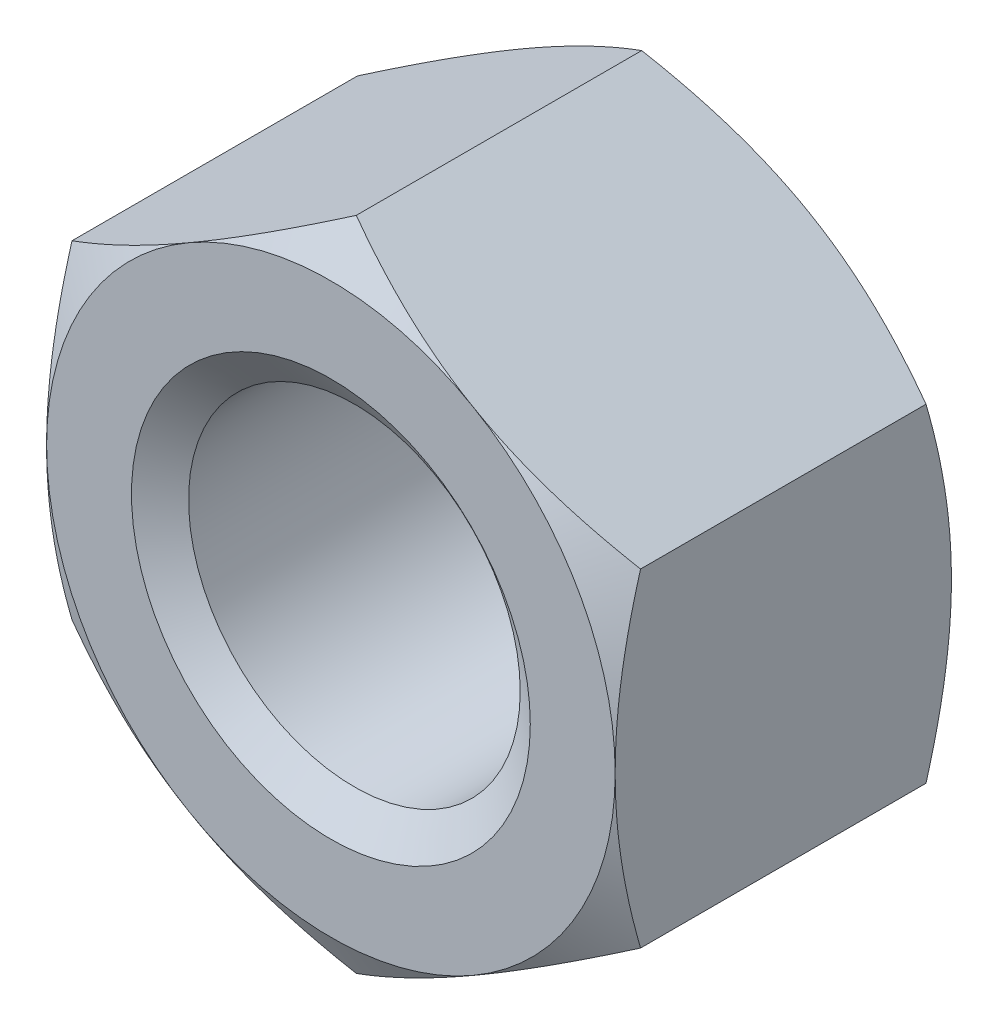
ISO-10303-21;
HEADER;
FILE_DESCRIPTION(('STEP AP214'),'2;1');
FILE_NAME('part.step','',(''),(''),'','','');
FILE_SCHEMA(('AUTOMOTIVE_DESIGN { 1 0 10303 214 1 1 1 1 }'));
ENDSEC;
DATA;
#1=APPLICATION_CONTEXT('core data for automotive mechanical design processes');
#2=APPLICATION_PROTOCOL_DEFINITION('international standard','automotive_design',2000,#1);
#3=PRODUCT_CONTEXT('',#1,'mechanical');
#4=PRODUCT('Part','Part','',(#3));
#5=PRODUCT_RELATED_PRODUCT_CATEGORY('part','',(#4));
#6=PRODUCT_DEFINITION_FORMATION('','',#4);
#7=PRODUCT_DEFINITION_CONTEXT('part definition',#1,'design');
#8=PRODUCT_DEFINITION('design','',#6,#7);
#9=PRODUCT_DEFINITION_SHAPE('','',#8);
#10=(LENGTH_UNIT() NAMED_UNIT(*) SI_UNIT(.MILLI.,.METRE.));
#11=(NAMED_UNIT(*) PLANE_ANGLE_UNIT() SI_UNIT($,.RADIAN.));
#12=(NAMED_UNIT(*) SI_UNIT($,.STERADIAN.) SOLID_ANGLE_UNIT());
#13=UNCERTAINTY_MEASURE_WITH_UNIT(LENGTH_MEASURE(1.E-05),#10,'distance_accuracy_value','');
#14=(GEOMETRIC_REPRESENTATION_CONTEXT(3) GLOBAL_UNCERTAINTY_ASSIGNED_CONTEXT((#13)) GLOBAL_UNIT_ASSIGNED_CONTEXT((#10,
#11,#12)) REPRESENTATION_CONTEXT('',''));
#15=CARTESIAN_POINT('',(0.,0.,0.));
#16=DIRECTION('',(0.,0.,1.));
#17=DIRECTION('',(1.,0.,0.));
#18=AXIS2_PLACEMENT_3D('',#15,#16,#17);
#19=CARTESIAN_POINT('',(0.,0.,-22.5298));
#20=DIRECTION('',(0.,0.,1.));
#21=DIRECTION('',(1.,0.,0.));
#22=AXIS2_PLACEMENT_3D('',#19,#20,#21);
#23=CYLINDRICAL_SURFACE('',#22,11.1125);
#24=CARTESIAN_POINT('',(0.,0.,-1.57546696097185));
#25=DIRECTION('',(0.,0.,1.));
#26=DIRECTION('',(1.,0.,0.));
#27=AXIS2_PLACEMENT_3D('',#24,#25,#26);
#28=CIRCLE('',#27,11.1125);
#29=CARTESIAN_POINT('',(11.1125,0.,-1.57546696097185));
#30=VERTEX_POINT('',#29);
#31=EDGE_CURVE('E174',#30,#30,#28,.F.);
#32=ORIENTED_EDGE('',*,*,#31,.F.);
#33=EDGE_LOOP('',(#32));
#34=FACE_BOUND('',#33,.T.);
#35=CARTESIAN_POINT('',(0.,0.,-20.9289330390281));
#36=DIRECTION('',(0.,0.,-1.));
#37=DIRECTION('',(-1.,0.,0.));
#38=AXIS2_PLACEMENT_3D('',#35,#36,#37);
#39=CIRCLE('',#38,11.1125);
#40=CARTESIAN_POINT('',(-11.1125,0.,-20.9289330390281));
#41=VERTEX_POINT('',#40);
#42=EDGE_CURVE('E38',#41,#41,#39,.F.);
#43=ORIENTED_EDGE('',*,*,#42,.F.);
#44=EDGE_LOOP('',(#43));
#45=FACE_BOUND('',#44,.T.);
#46=ADVANCED_FACE('F33',(#34,#45),#23,.F.);
#47=CARTESIAN_POINT('',(0.,21.9970452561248,-22.5298));
#48=DIRECTION('',(-0.500000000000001,0.866025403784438,0.));
#49=DIRECTION('',(-0.866025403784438,-0.500000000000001,0.));
#50=AXIS2_PLACEMENT_3D('',#47,#48,#49);
#51=PLANE('',#50);
#52=DIRECTION('',(0.,0.,1.));
#53=VECTOR('',#52,1.);
#54=CARTESIAN_POINT('',(-19.05,10.9985226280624,-22.5298));
#55=LINE('',#54,#53);
#56=CARTESIAN_POINT('',(-19.05,10.9985226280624,-20.8283226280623));
#57=VERTEX_POINT('',#56);
#58=CARTESIAN_POINT('',(-19.05,10.9985226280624,-1.70147737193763));
#59=VERTEX_POINT('',#58);
#60=EDGE_CURVE('E164',#57,#59,#55,.T.);
#61=ORIENTED_EDGE('',*,*,#60,.T.);
#62=CARTESIAN_POINT('',(-19.0502,10.9984071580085,-1.70154403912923));
#63=CARTESIAN_POINT('',(-18.6314889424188,11.2401500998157,-1.56198341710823));
#64=CARTESIAN_POINT('',(-18.2111446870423,11.4828359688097,-1.42875584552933));
#65=CARTESIAN_POINT('',(-17.3670855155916,11.9701537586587,-1.17672716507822));
#66=CARTESIAN_POINT('',(-16.9433695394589,12.2147862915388,-1.05793080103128));
#67=CARTESIAN_POINT('',(-16.0917480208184,12.7064702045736,-0.836361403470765));
#68=CARTESIAN_POINT('',(-15.6638350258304,12.9535258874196,-0.733626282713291));
#69=CARTESIAN_POINT('',(-14.8050356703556,13.4493539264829,-0.546385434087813));
#70=CARTESIAN_POINT('',(-14.374149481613,13.6981261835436,-0.461878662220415));
#71=CARTESIAN_POINT('',(-13.5204444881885,14.1910129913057,-0.314688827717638));
#72=CARTESIAN_POINT('',(-13.0976890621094,14.4350909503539,-0.251518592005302));
#73=CARTESIAN_POINT('',(-12.250241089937,14.9243652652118,-0.145596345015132));
#74=CARTESIAN_POINT('',(-11.8255485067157,15.1695616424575,-0.102844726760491));
#75=CARTESIAN_POINT('',(-10.9754499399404,15.6603662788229,-0.0388391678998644));
#76=CARTESIAN_POINT('',(-10.5500454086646,15.9059736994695,-0.0175596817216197));
#77=CARTESIAN_POINT('',(-9.6988436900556,16.397415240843,0.00304398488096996));
#78=CARTESIAN_POINT('',(-9.27304651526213,16.6432493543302,0.00236884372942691));
#79=CARTESIAN_POINT('',(-8.47700964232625,17.1028414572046,-0.0194033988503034));
#80=CARTESIAN_POINT('',(-8.10671322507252,17.316632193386,-0.0378455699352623));
#81=CARTESIAN_POINT('',(-7.3670036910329,17.7437036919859,-0.0909844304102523));
#82=CARTESIAN_POINT('',(-6.99759056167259,17.9569844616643,-0.125680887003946));
#83=CARTESIAN_POINT('',(-6.25978756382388,18.3829552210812,-0.210726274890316));
#84=CARTESIAN_POINT('',(-5.89139892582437,18.5956445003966,-0.261089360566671));
#85=CARTESIAN_POINT('',(-5.1563753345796,19.0200105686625,-0.376579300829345));
#86=CARTESIAN_POINT('',(-4.7897403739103,19.2316873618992,-0.441706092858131));
#87=CARTESIAN_POINT('',(-3.67677271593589,19.8742595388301,-0.660888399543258));
#88=CARTESIAN_POINT('',(-2.93366305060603,20.3032941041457,-0.836799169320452));
#89=CARTESIAN_POINT('',(-1.45852420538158,21.1549659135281,-1.23604434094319));
#90=CARTESIAN_POINT('',(-0.726476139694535,21.5776140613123,-1.45928498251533));
#91=CARTESIAN_POINT('',(0.000200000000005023,21.9971607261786,-1.70154403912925));
#92=B_SPLINE_CURVE_WITH_KNOTS('',3,(#62,#63,#64,#65,#66,#67,#68,#69,#70,#71,#72,#73,#74,#75,#76,
#77,#78,#79,#80,#81,#82,#83,#84,#85,#86,#87,#88,#89,#90,#91),.UNSPECIFIED.,.F.,.F.,(4,2,2,2,2,2,
2,2,2,2,2,2,2,2,4),(0.,1.50971559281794,3.01992622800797,4.53364959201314,6.04728623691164,
7.52356313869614,8.99986845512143,10.4744153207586,11.9489166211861,13.2325441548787,
14.5161533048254,15.8009255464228,17.085692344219,19.7118183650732,22.3327898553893),.UNSPECIFIED.);
#93=CARTESIAN_POINT('',(-9.52500000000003,16.4977839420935,0.));
#94=VERTEX_POINT('',#93);
#95=EDGE_CURVE('E60',#59,#94,#92,.T.);
#96=ORIENTED_EDGE('',*,*,#95,.T.);
#97=CARTESIAN_POINT('',(0.,21.9970452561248,-1.70147737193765));
#98=VERTEX_POINT('',#97);
#99=EDGE_CURVE('E243',#94,#98,#92,.T.);
#100=ORIENTED_EDGE('',*,*,#99,.T.);
#101=DIRECTION('',(0.,0.,1.));
#102=VECTOR('',#101,1.);
#103=CARTESIAN_POINT('',(0.,21.9970452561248,-22.5298));
#104=LINE('',#103,#102);
#105=CARTESIAN_POINT('',(0.,21.9970452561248,-20.8283226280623));
#106=VERTEX_POINT('',#105);
#107=EDGE_CURVE('E149',#106,#98,#104,.T.);
#108=ORIENTED_EDGE('',*,*,#107,.F.);
#109=CARTESIAN_POINT('',(-19.0502,10.9984071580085,-20.8282559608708));
#110=CARTESIAN_POINT('',(-18.6314889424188,11.2401500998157,-20.9678165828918));
#111=CARTESIAN_POINT('',(-18.2111446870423,11.4828359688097,-21.1010441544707));
#112=CARTESIAN_POINT('',(-17.3670855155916,11.9701537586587,-21.3530728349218));
#113=CARTESIAN_POINT('',(-16.9433695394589,12.2147862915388,-21.4718691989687));
#114=CARTESIAN_POINT('',(-16.0917480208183,12.7064702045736,-21.6934385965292));
#115=CARTESIAN_POINT('',(-15.6638350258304,12.9535258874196,-21.7961737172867));
#116=CARTESIAN_POINT('',(-14.8050356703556,13.4493539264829,-21.9834145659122));
#117=CARTESIAN_POINT('',(-14.374149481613,13.6981261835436,-22.0679213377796));
#118=CARTESIAN_POINT('',(-13.5204444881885,14.1910129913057,-22.2151111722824));
#119=CARTESIAN_POINT('',(-13.0976890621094,14.4350909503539,-22.2782814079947));
#120=CARTESIAN_POINT('',(-12.250241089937,14.9243652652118,-22.3842036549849));
#121=CARTESIAN_POINT('',(-11.8255485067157,15.1695616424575,-22.4269552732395));
#122=CARTESIAN_POINT('',(-10.9754499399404,15.6603662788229,-22.4909608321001));
#123=CARTESIAN_POINT('',(-10.5500454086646,15.9059736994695,-22.5122403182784));
#124=CARTESIAN_POINT('',(-9.6988436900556,16.397415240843,-22.532843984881));
#125=CARTESIAN_POINT('',(-9.27304651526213,16.6432493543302,-22.5321688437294));
#126=CARTESIAN_POINT('',(-8.47700964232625,17.1028414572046,-22.5103966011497));
#127=CARTESIAN_POINT('',(-8.10671322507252,17.316632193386,-22.4919544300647));
#128=CARTESIAN_POINT('',(-7.3670036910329,17.7437036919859,-22.4388155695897));
#129=CARTESIAN_POINT('',(-6.99759056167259,17.9569844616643,-22.404119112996));
#130=CARTESIAN_POINT('',(-6.25978756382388,18.3829552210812,-22.3190737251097));
#131=CARTESIAN_POINT('',(-5.89139892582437,18.5956445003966,-22.2687106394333));
#132=CARTESIAN_POINT('',(-5.1563753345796,19.0200105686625,-22.1532206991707));
#133=CARTESIAN_POINT('',(-4.7897403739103,19.2316873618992,-22.0880939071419));
#134=CARTESIAN_POINT('',(-3.67677271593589,19.8742595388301,-21.8689116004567));
#135=CARTESIAN_POINT('',(-2.93366305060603,20.3032941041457,-21.6930008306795));
#136=CARTESIAN_POINT('',(-1.45852420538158,21.1549659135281,-21.2937556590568));
#137=CARTESIAN_POINT('',(-0.726476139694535,21.5776140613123,-21.0705150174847));
#138=CARTESIAN_POINT('',(0.00020000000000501,21.9971607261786,-20.8282559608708));
#139=B_SPLINE_CURVE_WITH_KNOTS('',3,(#109,#110,#111,#112,#113,#114,#115,#116,#117,#118,#119,
#120,#121,#122,#123,#124,#125,#126,#127,#128,#129,#130,#131,#132,#133,#134,#135,#136,#137,#138),
.UNSPECIFIED.,.F.,.F.,(4,2,2,2,2,2,2,2,2,2,2,2,2,2,4),(0.,1.50971559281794,3.01992622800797,
4.53364959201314,6.04728623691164,7.52356313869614,8.99986845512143,10.4744153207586,
11.9489166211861,13.2325441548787,14.5161533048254,15.8009255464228,17.085692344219,
19.7118183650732,22.3327898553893),.UNSPECIFIED.);
#140=CARTESIAN_POINT('',(-9.52500000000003,16.4977839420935,-22.5298));
#141=VERTEX_POINT('',#140);
#142=EDGE_CURVE('E167',#141,#106,#139,.T.);
#143=ORIENTED_EDGE('',*,*,#142,.F.);
#144=EDGE_CURVE('E266',#57,#141,#139,.T.);
#145=ORIENTED_EDGE('',*,*,#144,.F.);
#146=EDGE_LOOP('',(#61,#96,#100,#108,#143,#145));
#147=FACE_BOUND('',#146,.T.);
#148=ADVANCED_FACE('F35',(#147),#51,.T.);
#149=CARTESIAN_POINT('',(19.05,10.9985226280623,-22.5298));
#150=DIRECTION('',(0.500000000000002,0.866025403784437,0.));
#151=DIRECTION('',(-0.866025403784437,0.500000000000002,0.));
#152=AXIS2_PLACEMENT_3D('',#149,#150,#151);
#153=PLANE('',#152);
#154=ORIENTED_EDGE('',*,*,#107,.T.);
#155=CARTESIAN_POINT('',(-0.000199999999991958,21.9971607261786,-1.70154403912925));
#156=CARTESIAN_POINT('',(0.41851105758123,21.7554177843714,-1.56198341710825));
#157=CARTESIAN_POINT('',(0.838855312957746,21.5127319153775,-1.42875584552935));
#158=CARTESIAN_POINT('',(1.68291448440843,21.0254141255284,-1.17672716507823));
#159=CARTESIAN_POINT('',(2.10663046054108,20.7807815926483,-1.05793080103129));
#160=CARTESIAN_POINT('',(2.95825197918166,20.2890976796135,-0.836361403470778));
#161=CARTESIAN_POINT('',(3.38616497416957,20.0420419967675,-0.733626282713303));
#162=CARTESIAN_POINT('',(4.24496432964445,19.5462139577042,-0.546385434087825));
#163=CARTESIAN_POINT('',(4.67585051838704,19.2974417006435,-0.461878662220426));
#164=CARTESIAN_POINT('',(5.52955551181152,18.8045548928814,-0.314688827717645));
#165=CARTESIAN_POINT('',(5.95231093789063,18.5604769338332,-0.251518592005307));
#166=CARTESIAN_POINT('',(6.799758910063,18.0712026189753,-0.145596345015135));
#167=CARTESIAN_POINT('',(7.22445149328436,17.8260062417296,-0.102844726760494));
#168=CARTESIAN_POINT('',(8.07455006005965,17.3352016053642,-0.0388391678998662));
#169=CARTESIAN_POINT('',(8.49995459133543,17.0895941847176,-0.0175596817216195));
#170=CARTESIAN_POINT('',(9.35115630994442,16.5981526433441,0.00304398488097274));
#171=CARTESIAN_POINT('',(9.77695348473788,16.3523185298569,0.00236884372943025));
#172=CARTESIAN_POINT('',(10.5729903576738,15.8927264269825,-0.0194033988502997));
#173=CARTESIAN_POINT('',(10.9432867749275,15.6789356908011,-0.0378455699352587));
#174=CARTESIAN_POINT('',(11.6829963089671,15.2518641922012,-0.0909844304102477));
#175=CARTESIAN_POINT('',(12.0524094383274,15.0385834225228,-0.12568088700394));
#176=CARTESIAN_POINT('',(12.7902124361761,14.6126126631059,-0.210726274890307));
#177=CARTESIAN_POINT('',(13.1586010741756,14.3999233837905,-0.261089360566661));
#178=CARTESIAN_POINT('',(13.8936246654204,13.9755573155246,-0.376579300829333));
#179=CARTESIAN_POINT('',(14.2602596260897,13.7638805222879,-0.441706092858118));
#180=CARTESIAN_POINT('',(15.3732272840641,13.121308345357,-0.660888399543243));
#181=CARTESIAN_POINT('',(16.116336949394,12.6922737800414,-0.836799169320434));
#182=CARTESIAN_POINT('',(17.5914757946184,11.840601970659,-1.23604434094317));
#183=CARTESIAN_POINT('',(18.3235238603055,11.4179538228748,-1.45928498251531));
#184=CARTESIAN_POINT('',(19.0502,10.9984071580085,-1.70154403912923));
#185=B_SPLINE_CURVE_WITH_KNOTS('',3,(#155,#156,#157,#158,#159,#160,#161,#162,#163,#164,#165,
#166,#167,#168,#169,#170,#171,#172,#173,#174,#175,#176,#177,#178,#179,#180,#181,#182,#183,#184),
.UNSPECIFIED.,.F.,.F.,(4,2,2,2,2,2,2,2,2,2,2,2,2,2,4),(0.,1.50971559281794,3.01992622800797,
4.53364959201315,6.04728623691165,7.52356313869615,8.99986845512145,10.4744153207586,
11.9489166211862,13.2325441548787,14.5161533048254,15.8009255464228,17.085692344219,
19.7118183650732,22.3327898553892),.UNSPECIFIED.);
#186=CARTESIAN_POINT('',(9.52500000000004,16.4977839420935,0.));
#187=VERTEX_POINT('',#186);
#188=EDGE_CURVE('E142',#98,#187,#185,.T.);
#189=ORIENTED_EDGE('',*,*,#188,.T.);
#190=CARTESIAN_POINT('',(19.05,10.9985226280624,-1.70147737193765));
#191=VERTEX_POINT('',#190);
#192=EDGE_CURVE('E128',#187,#191,#185,.T.);
#193=ORIENTED_EDGE('',*,*,#192,.T.);
#194=DIRECTION('',(0.,0.,1.));
#195=VECTOR('',#194,1.);
#196=CARTESIAN_POINT('',(19.05,10.9985226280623,-22.5298));
#197=LINE('',#196,#195);
#198=CARTESIAN_POINT('',(19.05,10.9985226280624,-20.8283226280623));
#199=VERTEX_POINT('',#198);
#200=EDGE_CURVE('E141',#199,#191,#197,.T.);
#201=ORIENTED_EDGE('',*,*,#200,.F.);
#202=CARTESIAN_POINT('',(-0.000199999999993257,21.9971607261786,-20.8282559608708));
#203=CARTESIAN_POINT('',(0.41851105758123,21.7554177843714,-20.9678165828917));
#204=CARTESIAN_POINT('',(0.838855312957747,21.5127319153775,-21.1010441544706));
#205=CARTESIAN_POINT('',(1.68291448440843,21.0254141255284,-21.3530728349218));
#206=CARTESIAN_POINT('',(2.10663046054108,20.7807815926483,-21.4718691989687));
#207=CARTESIAN_POINT('',(2.95825197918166,20.2890976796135,-21.6934385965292));
#208=CARTESIAN_POINT('',(3.38616497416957,20.0420419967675,-21.7961737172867));
#209=CARTESIAN_POINT('',(4.24496432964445,19.5462139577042,-21.9834145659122));
#210=CARTESIAN_POINT('',(4.67585051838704,19.2974417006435,-22.0679213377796));
#211=CARTESIAN_POINT('',(5.52955551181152,18.8045548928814,-22.2151111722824));
#212=CARTESIAN_POINT('',(5.95231093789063,18.5604769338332,-22.2782814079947));
#213=CARTESIAN_POINT('',(6.799758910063,18.0712026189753,-22.3842036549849));
#214=CARTESIAN_POINT('',(7.22445149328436,17.8260062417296,-22.4269552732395));
#215=CARTESIAN_POINT('',(8.07455006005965,17.3352016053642,-22.4909608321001));
#216=CARTESIAN_POINT('',(8.49995459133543,17.0895941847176,-22.5122403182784));
#217=CARTESIAN_POINT('',(9.35115630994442,16.5981526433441,-22.532843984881));
#218=CARTESIAN_POINT('',(9.77695348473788,16.3523185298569,-22.5321688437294));
#219=CARTESIAN_POINT('',(10.5729903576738,15.8927264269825,-22.5103966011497));
#220=CARTESIAN_POINT('',(10.9432867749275,15.6789356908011,-22.4919544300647));
#221=CARTESIAN_POINT('',(11.6829963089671,15.2518641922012,-22.4388155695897));
#222=CARTESIAN_POINT('',(12.0524094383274,15.0385834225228,-22.4041191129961));
#223=CARTESIAN_POINT('',(12.7902124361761,14.6126126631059,-22.3190737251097));
#224=CARTESIAN_POINT('',(13.1586010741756,14.3999233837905,-22.2687106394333));
#225=CARTESIAN_POINT('',(13.8936246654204,13.9755573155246,-22.1532206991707));
#226=CARTESIAN_POINT('',(14.2602596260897,13.7638805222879,-22.0880939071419));
#227=CARTESIAN_POINT('',(15.3732272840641,13.121308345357,-21.8689116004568));
#228=CARTESIAN_POINT('',(16.116336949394,12.6922737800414,-21.6930008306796));
#229=CARTESIAN_POINT('',(17.5914757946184,11.840601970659,-21.2937556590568));
#230=CARTESIAN_POINT('',(18.3235238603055,11.4179538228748,-21.0705150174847));
#231=CARTESIAN_POINT('',(19.0502,10.9984071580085,-20.8282559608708));
#232=B_SPLINE_CURVE_WITH_KNOTS('',3,(#202,#203,#204,#205,#206,#207,#208,#209,#210,#211,#212,
#213,#214,#215,#216,#217,#218,#219,#220,#221,#222,#223,#224,#225,#226,#227,#228,#229,#230,#231),
.UNSPECIFIED.,.F.,.F.,(4,2,2,2,2,2,2,2,2,2,2,2,2,2,4),(0.,1.50971559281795,3.01992622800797,
4.53364959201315,6.04728623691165,7.52356313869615,8.99986845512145,10.4744153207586,
11.9489166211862,13.2325441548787,14.5161533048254,15.8009255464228,17.085692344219,
19.7118183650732,22.3327898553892),.UNSPECIFIED.);
#233=CARTESIAN_POINT('',(9.52500000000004,16.4977839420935,-22.5298));
#234=VERTEX_POINT('',#233);
#235=EDGE_CURVE('E259',#234,#199,#232,.T.);
#236=ORIENTED_EDGE('',*,*,#235,.F.);
#237=EDGE_CURVE('E265',#106,#234,#232,.T.);
#238=ORIENTED_EDGE('',*,*,#237,.F.);
#239=EDGE_LOOP('',(#154,#189,#193,#201,#236,#238));
#240=FACE_BOUND('',#239,.T.);
#241=ADVANCED_FACE('F139',(#240),#153,.T.);
#242=CARTESIAN_POINT('',(19.05,10.9985226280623,-22.5298));
#243=DIRECTION('',(-1.,0.,0.));
#244=DIRECTION('',(0.,0.,1.));
#245=AXIS2_PLACEMENT_3D('',#242,#243,#244);
#246=PLANE('',#245);
#247=CARTESIAN_POINT('',(19.05,-29.1697028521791,-9.11593373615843));
#248=CARTESIAN_POINT('',(19.05,-28.7515170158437,-8.91378890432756));
#249=CARTESIAN_POINT('',(19.05,-28.3328257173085,-8.71269026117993));
#250=CARTESIAN_POINT('',(19.05,-27.494325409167,-8.31282549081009));
#251=CARTESIAN_POINT('',(19.05,-27.0745163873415,-8.11405938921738));
#252=CARTESIAN_POINT('',(19.05,-25.813129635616,-7.5215625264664));
#253=CARTESIAN_POINT('',(19.05,-24.9697281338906,-7.13169909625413));
#254=CARTESIAN_POINT('',(19.05,-23.2722707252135,-6.3625712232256));
#255=CARTESIAN_POINT('',(19.05,-22.4181814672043,-5.98338020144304));
#256=CARTESIAN_POINT('',(19.05,-20.7029839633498,-5.2412788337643));
#257=CARTESIAN_POINT('',(19.05,-19.8418760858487,-4.87836763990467));
#258=CARTESIAN_POINT('',(19.05,-18.1005821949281,-4.16885698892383));
#259=CARTESIAN_POINT('',(19.05,-17.2202917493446,-3.8225124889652));
#260=CARTESIAN_POINT('',(19.05,-15.4493217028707,-3.15694792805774));
#261=CARTESIAN_POINT('',(19.05,-14.5586409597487,-2.83773088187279));
#262=CARTESIAN_POINT('',(19.05,-12.7673320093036,-2.23500280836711));
#263=CARTESIAN_POINT('',(19.05,-11.8667295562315,-1.9514158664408));
#264=CARTESIAN_POINT('',(19.05,-10.0526343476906,-1.42914392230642));
#265=CARTESIAN_POINT('',(19.05,-9.13914576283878,-1.19044473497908));
#266=CARTESIAN_POINT('',(19.05,-7.75907469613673,-0.874799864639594));
#267=CARTESIAN_POINT('',(19.05,-7.29731333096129,-0.776636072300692));
#268=CARTESIAN_POINT('',(19.05,-6.37071732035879,-0.595993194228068));
#269=CARTESIAN_POINT('',(19.05,-5.90588274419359,-0.513513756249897));
#270=CARTESIAN_POINT('',(19.05,-4.97345228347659,-0.365701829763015));
#271=CARTESIAN_POINT('',(19.05,-4.50585623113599,-0.300370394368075));
#272=CARTESIAN_POINT('',(19.05,-3.56843861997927,-0.188166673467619));
#273=CARTESIAN_POINT('',(19.05,-3.09861705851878,-0.141294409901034));
#274=CARTESIAN_POINT('',(19.05,-2.16041609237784,-0.0672708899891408));
#275=CARTESIAN_POINT('',(19.05,-1.69204648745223,-0.0399962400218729));
#276=CARTESIAN_POINT('',(19.05,-0.754574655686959,-0.00531133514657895));
#277=CARTESIAN_POINT('',(19.05,-0.285472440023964,0.0020992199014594));
#278=CARTESIAN_POINT('',(19.05,0.652492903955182,-0.00311981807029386));
#279=CARTESIAN_POINT('',(19.05,1.12135606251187,-0.0157438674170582));
#280=CARTESIAN_POINT('',(19.05,2.05813737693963,-0.0607182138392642));
#281=CARTESIAN_POINT('',(19.05,2.52605549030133,-0.0930693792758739));
#282=CARTESIAN_POINT('',(19.05,3.65980250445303,-0.194680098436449));
#283=CARTESIAN_POINT('',(19.05,4.32476458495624,-0.273803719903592));
#284=CARTESIAN_POINT('',(19.05,5.64947952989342,-0.467485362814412));
#285=CARTESIAN_POINT('',(19.05,6.30923160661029,-0.582048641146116));
#286=CARTESIAN_POINT('',(19.05,8.28182382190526,-0.973151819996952));
#287=CARTESIAN_POINT('',(19.05,9.58542312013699,-1.29684470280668));
#288=CARTESIAN_POINT('',(19.05,11.5353898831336,-1.85499845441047));
#289=CARTESIAN_POINT('',(19.05,12.191945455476,-2.05588340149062));
#290=CARTESIAN_POINT('',(19.05,13.4987136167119,-2.47768236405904));
#291=CARTESIAN_POINT('',(19.05,14.1489256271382,-2.69859818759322));
#292=CARTESIAN_POINT('',(19.05,15.4397656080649,-3.15575174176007));
#293=CARTESIAN_POINT('',(19.05,16.080426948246,-3.39189604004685));
#294=CARTESIAN_POINT('',(19.05,17.0373840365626,-3.75633654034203));
#295=CARTESIAN_POINT('',(19.05,17.3556458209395,-3.87949985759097));
#296=CARTESIAN_POINT('',(19.05,17.9909330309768,-4.12895791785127));
#297=CARTESIAN_POINT('',(19.05,18.3079584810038,-4.2552525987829));
#298=CARTESIAN_POINT('',(19.05,18.6244086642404,-4.38297164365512));
#299=B_SPLINE_CURVE_WITH_KNOTS('',3,(#247,#248,#249,#250,#251,#252,#253,#254,#255,#256,#257,
#258,#259,#260,#261,#262,#263,#264,#265,#266,#267,#268,#269,#270,#271,#272,#273,#274,#275,#276,
#277,#278,#279,#280,#281,#282,#283,#284,#285,#286,#287,#288,#289,#290,#291,#292,#293,#294,#295,
#296,#297,#298),.UNSPECIFIED.,.F.,.F.,(4,2,2,2,2,2,2,2,2,2,2,2,2,2,2,2,2,2,2,2,2,2,2,2,2,4),(0.,
1.39343811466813,2.78689152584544,5.57425145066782,8.37756231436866,11.1807269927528,
14.0183059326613,16.856199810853,19.6879407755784,22.5187853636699,23.934802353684,
25.3507875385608,26.766859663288,28.1829334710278,29.5900111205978,30.9970675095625,
32.4037346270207,33.8104636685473,35.8182820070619,37.8263983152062,41.8503661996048,
43.910005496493,45.9698308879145,48.0180400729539,49.0418117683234,50.0655631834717),.UNSPECIFIED.);
#300=CARTESIAN_POINT('',(19.05,-10.9985226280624,-1.70147737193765));
#301=VERTEX_POINT('',#300);
#302=CARTESIAN_POINT('',(19.05,0.,0.));
#303=VERTEX_POINT('',#302);
#304=EDGE_CURVE('E134',#301,#303,#299,.T.);
#305=ORIENTED_EDGE('',*,*,#304,.F.);
#306=DIRECTION('',(0.,0.,1.));
#307=VECTOR('',#306,1.);
#308=CARTESIAN_POINT('',(19.05,-10.9985226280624,-22.5298));
#309=LINE('',#308,#307);
#310=CARTESIAN_POINT('',(19.05,-10.9985226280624,-20.8283226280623));
#311=VERTEX_POINT('',#310);
#312=EDGE_CURVE('E150',#311,#301,#309,.T.);
#313=ORIENTED_EDGE('',*,*,#312,.F.);
#314=CARTESIAN_POINT('',(19.05,-29.1697028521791,-13.4138662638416));
#315=CARTESIAN_POINT('',(19.05,-28.7515170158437,-13.6160110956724));
#316=CARTESIAN_POINT('',(19.05,-28.3328257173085,-13.8171097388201));
#317=CARTESIAN_POINT('',(19.05,-27.494325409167,-14.2169745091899));
#318=CARTESIAN_POINT('',(19.05,-27.0745163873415,-14.4157406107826));
#319=CARTESIAN_POINT('',(19.05,-25.813129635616,-15.0082374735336));
#320=CARTESIAN_POINT('',(19.05,-24.9697281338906,-15.3981009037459));
#321=CARTESIAN_POINT('',(19.05,-23.2722707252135,-16.1672287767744));
#322=CARTESIAN_POINT('',(19.05,-22.4181814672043,-16.546419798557));
#323=CARTESIAN_POINT('',(19.05,-20.7029839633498,-17.2885211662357));
#324=CARTESIAN_POINT('',(19.05,-19.8418760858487,-17.6514323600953));
#325=CARTESIAN_POINT('',(19.05,-18.1005821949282,-18.3609430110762));
#326=CARTESIAN_POINT('',(19.05,-17.2202917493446,-18.7072875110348));
#327=CARTESIAN_POINT('',(19.05,-15.4493217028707,-19.3728520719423));
#328=CARTESIAN_POINT('',(19.05,-14.5586409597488,-19.6920691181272));
#329=CARTESIAN_POINT('',(19.05,-12.7673320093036,-20.2947971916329));
#330=CARTESIAN_POINT('',(19.05,-11.8667295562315,-20.5783841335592));
#331=CARTESIAN_POINT('',(19.05,-10.0526343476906,-21.1006560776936));
#332=CARTESIAN_POINT('',(19.05,-9.13914576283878,-21.3393552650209));
#333=CARTESIAN_POINT('',(19.05,-7.75907469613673,-21.6550001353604));
#334=CARTESIAN_POINT('',(19.05,-7.29731333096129,-21.7531639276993));
#335=CARTESIAN_POINT('',(19.05,-6.37071732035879,-21.9338068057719));
#336=CARTESIAN_POINT('',(19.05,-5.90588274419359,-22.0162862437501));
#337=CARTESIAN_POINT('',(19.05,-4.97345228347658,-22.164098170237));
#338=CARTESIAN_POINT('',(19.05,-4.50585623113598,-22.2294296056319));
#339=CARTESIAN_POINT('',(19.05,-3.56843861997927,-22.3416333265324));
#340=CARTESIAN_POINT('',(19.05,-3.09861705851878,-22.388505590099));
#341=CARTESIAN_POINT('',(19.05,-2.16041609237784,-22.4625291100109));
#342=CARTESIAN_POINT('',(19.05,-1.69204648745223,-22.4898037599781));
#343=CARTESIAN_POINT('',(19.05,-0.754574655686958,-22.5244886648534));
#344=CARTESIAN_POINT('',(19.05,-0.285472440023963,-22.5318992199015));
#345=CARTESIAN_POINT('',(19.05,0.652492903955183,-22.5266801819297));
#346=CARTESIAN_POINT('',(19.05,1.12135606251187,-22.5140561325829));
#347=CARTESIAN_POINT('',(19.05,2.05813737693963,-22.4690817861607));
#348=CARTESIAN_POINT('',(19.05,2.52605549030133,-22.4367306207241));
#349=CARTESIAN_POINT('',(19.05,3.65980250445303,-22.3351199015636));
#350=CARTESIAN_POINT('',(19.05,4.32476458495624,-22.2559962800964));
#351=CARTESIAN_POINT('',(19.05,5.64947952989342,-22.0623146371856));
#352=CARTESIAN_POINT('',(19.05,6.30923160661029,-21.9477513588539));
#353=CARTESIAN_POINT('',(19.05,8.28182382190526,-21.556648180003));
#354=CARTESIAN_POINT('',(19.05,9.58542312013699,-21.2329552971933));
#355=CARTESIAN_POINT('',(19.05,11.5353898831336,-20.6748015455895));
#356=CARTESIAN_POINT('',(19.05,12.191945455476,-20.4739165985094));
#357=CARTESIAN_POINT('',(19.05,13.4987136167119,-20.052117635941));
#358=CARTESIAN_POINT('',(19.05,14.1489256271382,-19.8312018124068));
#359=CARTESIAN_POINT('',(19.05,15.4397656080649,-19.3740482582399));
#360=CARTESIAN_POINT('',(19.05,16.080426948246,-19.1379039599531));
#361=CARTESIAN_POINT('',(19.05,17.0373840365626,-18.773463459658));
#362=CARTESIAN_POINT('',(19.05,17.3556458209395,-18.650300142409));
#363=CARTESIAN_POINT('',(19.05,17.9909330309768,-18.4008420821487));
#364=CARTESIAN_POINT('',(19.05,18.3079584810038,-18.2745474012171));
#365=CARTESIAN_POINT('',(19.05,18.6244086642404,-18.1468283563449));
#366=B_SPLINE_CURVE_WITH_KNOTS('',3,(#314,#315,#316,#317,#318,#319,#320,#321,#322,#323,#324,
#325,#326,#327,#328,#329,#330,#331,#332,#333,#334,#335,#336,#337,#338,#339,#340,#341,#342,#343,
#344,#345,#346,#347,#348,#349,#350,#351,#352,#353,#354,#355,#356,#357,#358,#359,#360,#361,#362,
#363,#364,#365),.UNSPECIFIED.,.F.,.F.,(4,2,2,2,2,2,2,2,2,2,2,2,2,2,2,2,2,2,2,2,2,2,2,2,2,4),(0.,
1.39343811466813,2.78689152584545,5.57425145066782,8.37756231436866,11.1807269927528,
14.0183059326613,16.856199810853,19.6879407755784,22.5187853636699,23.934802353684,
25.3507875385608,26.766859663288,28.1829334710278,29.5900111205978,30.9970675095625,
32.4037346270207,33.8104636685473,35.8182820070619,37.8263983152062,41.8503661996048,
43.910005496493,45.9698308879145,48.0180400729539,49.0418117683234,50.0655631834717),.UNSPECIFIED.);
#367=CARTESIAN_POINT('',(19.05,0.,-22.5298));
#368=VERTEX_POINT('',#367);
#369=EDGE_CURVE('E272',#311,#368,#366,.T.);
#370=ORIENTED_EDGE('',*,*,#369,.T.);
#371=EDGE_CURVE('E148',#368,#199,#366,.T.);
#372=ORIENTED_EDGE('',*,*,#371,.T.);
#373=ORIENTED_EDGE('',*,*,#200,.T.);
#374=EDGE_CURVE('E125',#303,#191,#299,.T.);
#375=ORIENTED_EDGE('',*,*,#374,.F.);
#376=EDGE_LOOP('',(#305,#313,#370,#372,#373,#375));
#377=FACE_BOUND('',#376,.T.);
#378=ADVANCED_FACE('F145',(#377),#246,.F.);
#379=CARTESIAN_POINT('',(0.,-21.9970452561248,-22.5298));
#380=DIRECTION('',(0.500000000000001,-0.866025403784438,0.));
#381=DIRECTION('',(0.866025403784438,0.500000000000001,0.));
#382=AXIS2_PLACEMENT_3D('',#379,#380,#381);
#383=PLANE('',#382);
#384=ORIENTED_EDGE('',*,*,#312,.T.);
#385=CARTESIAN_POINT('',(19.0502,-10.9984071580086,-1.70154403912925));
#386=CARTESIAN_POINT('',(18.6314889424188,-11.2401500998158,-1.56198341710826));
#387=CARTESIAN_POINT('',(18.2111446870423,-11.4828359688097,-1.42875584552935));
#388=CARTESIAN_POINT('',(17.3670855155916,-11.9701537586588,-1.17672716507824));
#389=CARTESIAN_POINT('',(16.9433695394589,-12.2147862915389,-1.0579308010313));
#390=CARTESIAN_POINT('',(16.0917480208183,-12.7064702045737,-0.83636140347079));
#391=CARTESIAN_POINT('',(15.6638350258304,-12.9535258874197,-0.733626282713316));
#392=CARTESIAN_POINT('',(14.8050356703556,-13.449353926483,-0.546385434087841));
#393=CARTESIAN_POINT('',(14.374149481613,-13.6981261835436,-0.461878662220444));
#394=CARTESIAN_POINT('',(13.5204444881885,-14.1910129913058,-0.314688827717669));
#395=CARTESIAN_POINT('',(13.0976890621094,-14.435090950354,-0.251518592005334));
#396=CARTESIAN_POINT('',(12.250241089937,-14.9243652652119,-0.145596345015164));
#397=CARTESIAN_POINT('',(11.8255485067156,-15.1695616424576,-0.102844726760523));
#398=CARTESIAN_POINT('',(10.9754499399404,-15.660366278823,-0.0388391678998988));
#399=CARTESIAN_POINT('',(10.5500454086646,-15.9059736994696,-0.0175596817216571));
#400=CARTESIAN_POINT('',(9.69884369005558,-16.3974152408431,0.00304398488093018));
#401=CARTESIAN_POINT('',(9.27304651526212,-16.6432493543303,0.00236884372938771));
#402=CARTESIAN_POINT('',(8.47700964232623,-17.1028414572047,-0.0194033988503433));
#403=CARTESIAN_POINT('',(8.1067132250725,-17.3166321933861,-0.0378455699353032));
#404=CARTESIAN_POINT('',(7.36700369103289,-17.743703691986,-0.0909844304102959));
#405=CARTESIAN_POINT('',(6.99759056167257,-17.9569844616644,-0.125680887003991));
#406=CARTESIAN_POINT('',(6.25978756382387,-18.3829552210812,-0.210726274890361));
#407=CARTESIAN_POINT('',(5.89139892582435,-18.5956445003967,-0.261089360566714));
#408=CARTESIAN_POINT('',(5.15637533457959,-19.0200105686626,-0.376579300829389));
#409=CARTESIAN_POINT('',(4.78974037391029,-19.2316873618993,-0.441706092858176));
#410=CARTESIAN_POINT('',(3.67677271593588,-19.8742595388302,-0.660888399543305));
#411=CARTESIAN_POINT('',(2.93366305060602,-20.3032941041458,-0.836799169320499));
#412=CARTESIAN_POINT('',(1.45852420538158,-21.1549659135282,-1.23604434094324));
#413=CARTESIAN_POINT('',(0.726476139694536,-21.5776140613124,-1.45928498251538));
#414=CARTESIAN_POINT('',(-0.000200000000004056,-21.9971607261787,-1.70154403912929));
#415=B_SPLINE_CURVE_WITH_KNOTS('',3,(#385,#386,#387,#388,#389,#390,#391,#392,#393,#394,#395,
#396,#397,#398,#399,#400,#401,#402,#403,#404,#405,#406,#407,#408,#409,#410,#411,#412,#413,#414),
.UNSPECIFIED.,.F.,.F.,(4,2,2,2,2,2,2,2,2,2,2,2,2,2,4),(0.,1.50971559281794,3.01992622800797,
4.53364959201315,6.04728623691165,7.52356313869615,8.99986845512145,10.4744153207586,
11.9489166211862,13.2325441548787,14.5161533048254,15.8009255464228,17.085692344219,
19.7118183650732,22.3327898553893),.UNSPECIFIED.);
#416=CARTESIAN_POINT('',(9.52500000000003,-16.4977839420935,0.));
#417=VERTEX_POINT('',#416);
#418=EDGE_CURVE('E545',#301,#417,#415,.T.);
#419=ORIENTED_EDGE('',*,*,#418,.T.);
#420=CARTESIAN_POINT('',(-1.42247325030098E-13,-21.9970452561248,-1.70147737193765));
#421=VERTEX_POINT('',#420);
#422=EDGE_CURVE('E227',#417,#421,#415,.T.);
#423=ORIENTED_EDGE('',*,*,#422,.T.);
#424=DIRECTION('',(0.,0.,1.));
#425=VECTOR('',#424,1.);
#426=CARTESIAN_POINT('',(0.,-21.9970452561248,-22.5298));
#427=LINE('',#426,#425);
#428=CARTESIAN_POINT('',(-1.42247325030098E-13,-21.9970452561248,-20.8283226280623));
#429=VERTEX_POINT('',#428);
#430=EDGE_CURVE('E155',#429,#421,#427,.T.);
#431=ORIENTED_EDGE('',*,*,#430,.F.);
#432=CARTESIAN_POINT('',(19.0502,-10.9984071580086,-20.8282559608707));
#433=CARTESIAN_POINT('',(18.6314889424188,-11.2401500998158,-20.9678165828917));
#434=CARTESIAN_POINT('',(18.2111446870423,-11.4828359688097,-21.1010441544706));
#435=CARTESIAN_POINT('',(17.3670855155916,-11.9701537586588,-21.3530728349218));
#436=CARTESIAN_POINT('',(16.9433695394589,-12.2147862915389,-21.4718691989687));
#437=CARTESIAN_POINT('',(16.0917480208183,-12.7064702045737,-21.6934385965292));
#438=CARTESIAN_POINT('',(15.6638350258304,-12.9535258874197,-21.7961737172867));
#439=CARTESIAN_POINT('',(14.8050356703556,-13.449353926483,-21.9834145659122));
#440=CARTESIAN_POINT('',(14.374149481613,-13.6981261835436,-22.0679213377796));
#441=CARTESIAN_POINT('',(13.5204444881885,-14.1910129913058,-22.2151111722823));
#442=CARTESIAN_POINT('',(13.0976890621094,-14.435090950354,-22.2782814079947));
#443=CARTESIAN_POINT('',(12.250241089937,-14.9243652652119,-22.3842036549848));
#444=CARTESIAN_POINT('',(11.8255485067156,-15.1695616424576,-22.4269552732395));
#445=CARTESIAN_POINT('',(10.9754499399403,-15.660366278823,-22.4909608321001));
#446=CARTESIAN_POINT('',(10.5500454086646,-15.9059736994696,-22.5122403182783));
#447=CARTESIAN_POINT('',(9.69884369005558,-16.3974152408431,-22.5328439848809));
#448=CARTESIAN_POINT('',(9.27304651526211,-16.6432493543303,-22.5321688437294));
#449=CARTESIAN_POINT('',(8.47700964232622,-17.1028414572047,-22.5103966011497));
#450=CARTESIAN_POINT('',(8.1067132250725,-17.3166321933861,-22.4919544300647));
#451=CARTESIAN_POINT('',(7.36700369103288,-17.743703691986,-22.4388155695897));
#452=CARTESIAN_POINT('',(6.99759056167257,-17.9569844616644,-22.404119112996));
#453=CARTESIAN_POINT('',(6.25978756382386,-18.3829552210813,-22.3190737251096));
#454=CARTESIAN_POINT('',(5.89139892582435,-18.5956445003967,-22.2687106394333));
#455=CARTESIAN_POINT('',(5.15637533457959,-19.0200105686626,-22.1532206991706));
#456=CARTESIAN_POINT('',(4.78974037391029,-19.2316873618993,-22.0880939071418));
#457=CARTESIAN_POINT('',(3.67677271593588,-19.8742595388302,-21.8689116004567));
#458=CARTESIAN_POINT('',(2.93366305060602,-20.3032941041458,-21.6930008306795));
#459=CARTESIAN_POINT('',(1.45852420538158,-21.1549659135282,-21.2937556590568));
#460=CARTESIAN_POINT('',(0.726476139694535,-21.5776140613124,-21.0705150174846));
#461=CARTESIAN_POINT('',(-0.000200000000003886,-21.9971607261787,-20.8282559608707));
#462=B_SPLINE_CURVE_WITH_KNOTS('',3,(#432,#433,#434,#435,#436,#437,#438,#439,#440,#441,#442,
#443,#444,#445,#446,#447,#448,#449,#450,#451,#452,#453,#454,#455,#456,#457,#458,#459,#460,#461),
.UNSPECIFIED.,.F.,.F.,(4,2,2,2,2,2,2,2,2,2,2,2,2,2,4),(0.,1.50971559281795,3.01992622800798,
4.53364959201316,6.04728623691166,7.52356313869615,8.99986845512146,10.4744153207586,
11.9489166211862,13.2325441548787,14.5161533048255,15.8009255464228,17.085692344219,
19.7118183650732,22.3327898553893),.UNSPECIFIED.);
#463=CARTESIAN_POINT('',(9.52500000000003,-16.4977839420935,-22.5298));
#464=VERTEX_POINT('',#463);
#465=EDGE_CURVE('E279',#464,#429,#462,.T.);
#466=ORIENTED_EDGE('',*,*,#465,.F.);
#467=EDGE_CURVE('E278',#311,#464,#462,.T.);
#468=ORIENTED_EDGE('',*,*,#467,.F.);
#469=EDGE_LOOP('',(#384,#419,#423,#431,#466,#468));
#470=FACE_BOUND('',#469,.T.);
#471=ADVANCED_FACE('F291',(#470),#383,.T.);
#472=CARTESIAN_POINT('',(-19.05,-10.9985226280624,-22.5298));
#473=DIRECTION('',(-0.500000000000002,-0.866025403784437,0.));
#474=DIRECTION('',(0.866025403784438,-0.500000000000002,0.));
#475=AXIS2_PLACEMENT_3D('',#472,#473,#474);
#476=PLANE('',#475);
#477=ORIENTED_EDGE('',*,*,#430,.T.);
#478=CARTESIAN_POINT('',(0.000199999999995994,-21.9971607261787,-1.70154403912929));
#479=CARTESIAN_POINT('',(-0.418511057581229,-21.7554177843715,-1.5619834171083));
#480=CARTESIAN_POINT('',(-0.838855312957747,-21.5127319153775,-1.42875584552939));
#481=CARTESIAN_POINT('',(-1.68291448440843,-21.0254141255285,-1.17672716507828));
#482=CARTESIAN_POINT('',(-2.10663046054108,-20.7807815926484,-1.05793080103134));
#483=CARTESIAN_POINT('',(-2.95825197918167,-20.2890976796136,-0.836361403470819));
#484=CARTESIAN_POINT('',(-3.38616497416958,-20.0420419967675,-0.733626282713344));
#485=CARTESIAN_POINT('',(-4.24496432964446,-19.5462139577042,-0.546385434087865));
#486=CARTESIAN_POINT('',(-4.67585051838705,-19.2974417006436,-0.461878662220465));
#487=CARTESIAN_POINT('',(-5.52955551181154,-18.8045548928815,-0.314688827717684));
#488=CARTESIAN_POINT('',(-5.95231093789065,-18.5604769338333,-0.251518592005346));
#489=CARTESIAN_POINT('',(-6.79975891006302,-18.0712026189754,-0.145596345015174));
#490=CARTESIAN_POINT('',(-7.22445149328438,-17.8260062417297,-0.102844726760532));
#491=CARTESIAN_POINT('',(-8.07455006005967,-17.3352016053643,-0.0388391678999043));
#492=CARTESIAN_POINT('',(-8.49995459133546,-17.0895941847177,-0.0175596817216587));
#493=CARTESIAN_POINT('',(-9.35115630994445,-16.5981526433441,0.00304398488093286));
#494=CARTESIAN_POINT('',(-9.77695348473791,-16.3523185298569,0.00236884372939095));
#495=CARTESIAN_POINT('',(-10.5729903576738,-15.8927264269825,-0.0194033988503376));
#496=CARTESIAN_POINT('',(-10.9432867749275,-15.6789356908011,-0.0378455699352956));
#497=CARTESIAN_POINT('',(-11.6829963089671,-15.2518641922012,-0.0909844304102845));
#498=CARTESIAN_POINT('',(-12.0524094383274,-15.0385834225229,-0.125680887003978));
#499=CARTESIAN_POINT('',(-12.7902124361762,-14.612612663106,-0.210726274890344));
#500=CARTESIAN_POINT('',(-13.1586010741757,-14.3999233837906,-0.261089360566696));
#501=CARTESIAN_POINT('',(-13.8936246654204,-13.9755573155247,-0.376579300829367));
#502=CARTESIAN_POINT('',(-14.2602596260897,-13.7638805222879,-0.441706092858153));
#503=CARTESIAN_POINT('',(-15.3732272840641,-13.1213083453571,-0.660888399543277));
#504=CARTESIAN_POINT('',(-16.116336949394,-12.6922737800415,-0.836799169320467));
#505=CARTESIAN_POINT('',(-17.5914757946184,-11.8406019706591,-1.2360443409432));
#506=CARTESIAN_POINT('',(-18.3235238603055,-11.4179538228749,-1.45928498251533));
#507=CARTESIAN_POINT('',(-19.0502,-10.9984071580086,-1.70154403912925));
#508=B_SPLINE_CURVE_WITH_KNOTS('',3,(#478,#479,#480,#481,#482,#483,#484,#485,#486,#487,#488,
#489,#490,#491,#492,#493,#494,#495,#496,#497,#498,#499,#500,#501,#502,#503,#504,#505,#506,#507),
.UNSPECIFIED.,.F.,.F.,(4,2,2,2,2,2,2,2,2,2,2,2,2,2,4),(0.,1.50971559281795,3.01992622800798,
4.53364959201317,6.04728623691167,7.52356313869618,8.99986845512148,10.4744153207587,
11.9489166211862,13.2325441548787,14.5161533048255,15.8009255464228,17.085692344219,
19.7118183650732,22.3327898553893),.UNSPECIFIED.);
#509=CARTESIAN_POINT('',(-9.52500000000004,-16.4977839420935,0.));
#510=VERTEX_POINT('',#509);
#511=EDGE_CURVE('E543',#421,#510,#508,.T.);
#512=ORIENTED_EDGE('',*,*,#511,.T.);
#513=CARTESIAN_POINT('',(-19.05,-10.9985226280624,-1.70147737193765));
#514=VERTEX_POINT('',#513);
#515=EDGE_CURVE('E199',#510,#514,#508,.T.);
#516=ORIENTED_EDGE('',*,*,#515,.T.);
#517=DIRECTION('',(0.,0.,1.));
#518=VECTOR('',#517,1.);
#519=CARTESIAN_POINT('',(-19.05,-10.9985226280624,-22.5298));
#520=LINE('',#519,#518);
#521=CARTESIAN_POINT('',(-19.05,-10.9985226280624,-20.8283226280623));
#522=VERTEX_POINT('',#521);
#523=EDGE_CURVE('E161',#522,#514,#520,.T.);
#524=ORIENTED_EDGE('',*,*,#523,.F.);
#525=CARTESIAN_POINT('',(0.000199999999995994,-21.9971607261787,-20.8282559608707));
#526=CARTESIAN_POINT('',(-0.41851105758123,-21.7554177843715,-20.9678165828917));
#527=CARTESIAN_POINT('',(-0.838855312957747,-21.5127319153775,-21.1010441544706));
#528=CARTESIAN_POINT('',(-1.68291448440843,-21.0254141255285,-21.3530728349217));
#529=CARTESIAN_POINT('',(-2.10663046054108,-20.7807815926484,-21.4718691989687));
#530=CARTESIAN_POINT('',(-2.95825197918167,-20.2890976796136,-21.6934385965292));
#531=CARTESIAN_POINT('',(-3.38616497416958,-20.0420419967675,-21.7961737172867));
#532=CARTESIAN_POINT('',(-4.24496432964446,-19.5462139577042,-21.9834145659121));
#533=CARTESIAN_POINT('',(-4.67585051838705,-19.2974417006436,-22.0679213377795));
#534=CARTESIAN_POINT('',(-5.52955551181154,-18.8045548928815,-22.2151111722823));
#535=CARTESIAN_POINT('',(-5.95231093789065,-18.5604769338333,-22.2782814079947));
#536=CARTESIAN_POINT('',(-6.79975891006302,-18.0712026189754,-22.3842036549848));
#537=CARTESIAN_POINT('',(-7.22445149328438,-17.8260062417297,-22.4269552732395));
#538=CARTESIAN_POINT('',(-8.07455006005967,-17.3352016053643,-22.4909608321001));
#539=CARTESIAN_POINT('',(-8.49995459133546,-17.0895941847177,-22.5122403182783));
#540=CARTESIAN_POINT('',(-9.35115630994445,-16.5981526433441,-22.5328439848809));
#541=CARTESIAN_POINT('',(-9.77695348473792,-16.3523185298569,-22.5321688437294));
#542=CARTESIAN_POINT('',(-10.5729903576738,-15.8927264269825,-22.5103966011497));
#543=CARTESIAN_POINT('',(-10.9432867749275,-15.6789356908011,-22.4919544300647));
#544=CARTESIAN_POINT('',(-11.6829963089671,-15.2518641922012,-22.4388155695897));
#545=CARTESIAN_POINT('',(-12.0524094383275,-15.0385834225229,-22.404119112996));
#546=CARTESIAN_POINT('',(-12.7902124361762,-14.612612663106,-22.3190737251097));
#547=CARTESIAN_POINT('',(-13.1586010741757,-14.3999233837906,-22.2687106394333));
#548=CARTESIAN_POINT('',(-13.8936246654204,-13.9755573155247,-22.1532206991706));
#549=CARTESIAN_POINT('',(-14.2602596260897,-13.7638805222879,-22.0880939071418));
#550=CARTESIAN_POINT('',(-15.3732272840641,-13.1213083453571,-21.8689116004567));
#551=CARTESIAN_POINT('',(-16.116336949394,-12.6922737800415,-21.6930008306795));
#552=CARTESIAN_POINT('',(-17.5914757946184,-11.8406019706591,-21.2937556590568));
#553=CARTESIAN_POINT('',(-18.3235238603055,-11.4179538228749,-21.0705150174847));
#554=CARTESIAN_POINT('',(-19.0502,-10.9984071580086,-20.8282559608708));
#555=B_SPLINE_CURVE_WITH_KNOTS('',3,(#525,#526,#527,#528,#529,#530,#531,#532,#533,#534,#535,
#536,#537,#538,#539,#540,#541,#542,#543,#544,#545,#546,#547,#548,#549,#550,#551,#552,#553,#554),
.UNSPECIFIED.,.F.,.F.,(4,2,2,2,2,2,2,2,2,2,2,2,2,2,4),(0.,1.50971559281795,3.01992622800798,
4.53364959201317,6.04728623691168,7.52356313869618,8.99986845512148,10.4744153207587,
11.9489166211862,13.2325441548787,14.5161533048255,15.8009255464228,17.085692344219,
19.7118183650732,22.3327898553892),.UNSPECIFIED.);
#556=CARTESIAN_POINT('',(-9.52500000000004,-16.4977839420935,-22.5298));
#557=VERTEX_POINT('',#556);
#558=EDGE_CURVE('E286',#557,#522,#555,.T.);
#559=ORIENTED_EDGE('',*,*,#558,.F.);
#560=EDGE_CURVE('E285',#429,#557,#555,.T.);
#561=ORIENTED_EDGE('',*,*,#560,.F.);
#562=EDGE_LOOP('',(#477,#512,#516,#524,#559,#561));
#563=FACE_BOUND('',#562,.T.);
#564=ADVANCED_FACE('F294',(#563),#476,.T.);
#565=CARTESIAN_POINT('',(-19.05,10.9985226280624,-22.5298));
#566=DIRECTION('',(-1.,0.,0.));
#567=DIRECTION('',(0.,0.,1.));
#568=AXIS2_PLACEMENT_3D('',#565,#566,#567);
#569=PLANE('',#568);
#570=ORIENTED_EDGE('',*,*,#523,.T.);
#571=CARTESIAN_POINT('',(-19.05,-29.169702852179,-9.11593373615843));
#572=CARTESIAN_POINT('',(-19.05,-28.7515170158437,-8.91378890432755));
#573=CARTESIAN_POINT('',(-19.05,-28.3328257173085,-8.71269026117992));
#574=CARTESIAN_POINT('',(-19.05,-27.494325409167,-8.31282549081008));
#575=CARTESIAN_POINT('',(-19.05,-27.0745163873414,-8.11405938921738));
#576=CARTESIAN_POINT('',(-19.05,-25.813129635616,-7.5215625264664));
#577=CARTESIAN_POINT('',(-19.05,-24.9697281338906,-7.13169909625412));
#578=CARTESIAN_POINT('',(-19.05,-23.2722707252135,-6.3625712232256));
#579=CARTESIAN_POINT('',(-19.05,-22.4181814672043,-5.98338020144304));
#580=CARTESIAN_POINT('',(-19.05,-20.7029839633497,-5.24127883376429));
#581=CARTESIAN_POINT('',(-19.05,-19.8418760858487,-4.87836763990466));
#582=CARTESIAN_POINT('',(-19.05,-18.1005821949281,-4.16885698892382));
#583=CARTESIAN_POINT('',(-19.05,-17.2202917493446,-3.8225124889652));
#584=CARTESIAN_POINT('',(-19.05,-15.4493217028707,-3.15694792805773));
#585=CARTESIAN_POINT('',(-19.05,-14.5586409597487,-2.83773088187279));
#586=CARTESIAN_POINT('',(-19.05,-12.7673320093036,-2.23500280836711));
#587=CARTESIAN_POINT('',(-19.05,-11.8667295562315,-1.9514158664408));
#588=CARTESIAN_POINT('',(-19.05,-10.0526343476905,-1.42914392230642));
#589=CARTESIAN_POINT('',(-19.05,-9.13914576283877,-1.19044473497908));
#590=CARTESIAN_POINT('',(-19.05,-7.75907469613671,-0.87479986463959));
#591=CARTESIAN_POINT('',(-19.05,-7.29731333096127,-0.776636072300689));
#592=CARTESIAN_POINT('',(-19.05,-6.37071732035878,-0.595993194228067));
#593=CARTESIAN_POINT('',(-19.05,-5.90588274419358,-0.513513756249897));
#594=CARTESIAN_POINT('',(-19.05,-4.97345228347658,-0.365701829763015));
#595=CARTESIAN_POINT('',(-19.05,-4.50585623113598,-0.300370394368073));
#596=CARTESIAN_POINT('',(-19.05,-3.56843861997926,-0.188166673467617));
#597=CARTESIAN_POINT('',(-19.05,-3.09861705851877,-0.141294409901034));
#598=CARTESIAN_POINT('',(-19.05,-2.16041609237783,-0.0672708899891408));
#599=CARTESIAN_POINT('',(-19.05,-1.69204648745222,-0.0399962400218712));
#600=CARTESIAN_POINT('',(-19.05,-0.754574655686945,-0.00531133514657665));
#601=CARTESIAN_POINT('',(-19.05,-0.285472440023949,0.00209921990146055));
#602=CARTESIAN_POINT('',(-19.05,0.652492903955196,-0.00311981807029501));
#603=CARTESIAN_POINT('',(-19.05,1.12135606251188,-0.0157438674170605));
#604=CARTESIAN_POINT('',(-19.05,2.05813737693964,-0.060718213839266));
#605=CARTESIAN_POINT('',(-19.05,2.52605549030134,-0.0930693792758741));
#606=CARTESIAN_POINT('',(-19.05,3.65980250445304,-0.194680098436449));
#607=CARTESIAN_POINT('',(-19.05,4.32476458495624,-0.273803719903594));
#608=CARTESIAN_POINT('',(-19.05,5.64947952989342,-0.467485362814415));
#609=CARTESIAN_POINT('',(-19.05,6.3092316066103,-0.582048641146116));
#610=CARTESIAN_POINT('',(-19.05,8.28182382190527,-0.97315181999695));
#611=CARTESIAN_POINT('',(-19.05,9.58542312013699,-1.29684470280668));
#612=CARTESIAN_POINT('',(-19.05,11.5353898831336,-1.85499845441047));
#613=CARTESIAN_POINT('',(-19.05,12.191945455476,-2.05588340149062));
#614=CARTESIAN_POINT('',(-19.05,13.4987136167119,-2.47768236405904));
#615=CARTESIAN_POINT('',(-19.05,14.1489256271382,-2.69859818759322));
#616=CARTESIAN_POINT('',(-19.05,15.4397656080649,-3.15575174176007));
#617=CARTESIAN_POINT('',(-19.05,16.080426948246,-3.39189604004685));
#618=CARTESIAN_POINT('',(-19.05,17.0373840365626,-3.75633654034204));
#619=CARTESIAN_POINT('',(-19.05,17.3556458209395,-3.87949985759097));
#620=CARTESIAN_POINT('',(-19.05,17.9909330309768,-4.12895791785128));
#621=CARTESIAN_POINT('',(-19.05,18.3079584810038,-4.25525259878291));
#622=CARTESIAN_POINT('',(-19.05,18.6244086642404,-4.38297164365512));
#623=B_SPLINE_CURVE_WITH_KNOTS('',3,(#571,#572,#573,#574,#575,#576,#577,#578,#579,#580,#581,
#582,#583,#584,#585,#586,#587,#588,#589,#590,#591,#592,#593,#594,#595,#596,#597,#598,#599,#600,
#601,#602,#603,#604,#605,#606,#607,#608,#609,#610,#611,#612,#613,#614,#615,#616,#617,#618,#619,
#620,#621,#622),.UNSPECIFIED.,.F.,.F.,(4,2,2,2,2,2,2,2,2,2,2,2,2,2,2,2,2,2,2,2,2,2,2,2,2,4),(0.,
1.39343811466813,2.78689152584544,5.57425145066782,8.37756231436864,11.1807269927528,
14.0183059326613,16.856199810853,19.6879407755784,22.5187853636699,23.934802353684,
25.3507875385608,26.766859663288,28.1829334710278,29.5900111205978,30.9970675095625,
32.4037346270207,33.8104636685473,35.8182820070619,37.8263983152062,41.8503661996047,
43.9100054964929,45.9698308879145,48.0180400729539,49.0418117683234,50.0655631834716),.UNSPECIFIED.);
#624=CARTESIAN_POINT('',(-19.05,0.,0.));
#625=VERTEX_POINT('',#624);
#626=EDGE_CURVE('E198',#514,#625,#623,.T.);
#627=ORIENTED_EDGE('',*,*,#626,.T.);
#628=EDGE_CURVE('E191',#625,#59,#623,.T.);
#629=ORIENTED_EDGE('',*,*,#628,.T.);
#630=ORIENTED_EDGE('',*,*,#60,.F.);
#631=CARTESIAN_POINT('',(-19.05,-29.169702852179,-13.4138662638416));
#632=CARTESIAN_POINT('',(-19.05,-28.7515170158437,-13.6160110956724));
#633=CARTESIAN_POINT('',(-19.05,-28.3328257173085,-13.8171097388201));
#634=CARTESIAN_POINT('',(-19.05,-27.494325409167,-14.2169745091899));
#635=CARTESIAN_POINT('',(-19.05,-27.0745163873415,-14.4157406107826));
#636=CARTESIAN_POINT('',(-19.05,-25.813129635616,-15.0082374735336));
#637=CARTESIAN_POINT('',(-19.05,-24.9697281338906,-15.3981009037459));
#638=CARTESIAN_POINT('',(-19.05,-23.2722707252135,-16.1672287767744));
#639=CARTESIAN_POINT('',(-19.05,-22.4181814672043,-16.546419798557));
#640=CARTESIAN_POINT('',(-19.05,-20.7029839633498,-17.2885211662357));
#641=CARTESIAN_POINT('',(-19.05,-19.8418760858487,-17.6514323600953));
#642=CARTESIAN_POINT('',(-19.05,-18.1005821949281,-18.3609430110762));
#643=CARTESIAN_POINT('',(-19.05,-17.2202917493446,-18.7072875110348));
#644=CARTESIAN_POINT('',(-19.05,-15.4493217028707,-19.3728520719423));
#645=CARTESIAN_POINT('',(-19.05,-14.5586409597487,-19.6920691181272));
#646=CARTESIAN_POINT('',(-19.05,-12.7673320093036,-20.2947971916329));
#647=CARTESIAN_POINT('',(-19.05,-11.8667295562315,-20.5783841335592));
#648=CARTESIAN_POINT('',(-19.05,-10.0526343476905,-21.1006560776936));
#649=CARTESIAN_POINT('',(-19.05,-9.13914576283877,-21.3393552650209));
#650=CARTESIAN_POINT('',(-19.05,-7.75907469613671,-21.6550001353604));
#651=CARTESIAN_POINT('',(-19.05,-7.29731333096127,-21.7531639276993));
#652=CARTESIAN_POINT('',(-19.05,-6.37071732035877,-21.9338068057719));
#653=CARTESIAN_POINT('',(-19.05,-5.90588274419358,-22.0162862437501));
#654=CARTESIAN_POINT('',(-19.05,-4.97345228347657,-22.164098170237));
#655=CARTESIAN_POINT('',(-19.05,-4.50585623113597,-22.2294296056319));
#656=CARTESIAN_POINT('',(-19.05,-3.56843861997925,-22.3416333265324));
#657=CARTESIAN_POINT('',(-19.05,-3.09861705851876,-22.388505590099));
#658=CARTESIAN_POINT('',(-19.05,-2.16041609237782,-22.4625291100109));
#659=CARTESIAN_POINT('',(-19.05,-1.69204648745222,-22.4898037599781));
#660=CARTESIAN_POINT('',(-19.05,-0.754574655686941,-22.5244886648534));
#661=CARTESIAN_POINT('',(-19.05,-0.285472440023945,-22.5318992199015));
#662=CARTESIAN_POINT('',(-19.05,0.6524929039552,-22.5266801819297));
#663=CARTESIAN_POINT('',(-19.05,1.12135606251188,-22.5140561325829));
#664=CARTESIAN_POINT('',(-19.05,2.05813737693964,-22.4690817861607));
#665=CARTESIAN_POINT('',(-19.05,2.52605549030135,-22.4367306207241));
#666=CARTESIAN_POINT('',(-19.05,3.65980250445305,-22.3351199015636));
#667=CARTESIAN_POINT('',(-19.05,4.32476458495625,-22.2559962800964));
#668=CARTESIAN_POINT('',(-19.05,5.64947952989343,-22.0623146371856));
#669=CARTESIAN_POINT('',(-19.05,6.3092316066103,-21.9477513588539));
#670=CARTESIAN_POINT('',(-19.05,8.28182382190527,-21.556648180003));
#671=CARTESIAN_POINT('',(-19.05,9.58542312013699,-21.2329552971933));
#672=CARTESIAN_POINT('',(-19.05,11.5353898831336,-20.6748015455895));
#673=CARTESIAN_POINT('',(-19.05,12.191945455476,-20.4739165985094));
#674=CARTESIAN_POINT('',(-19.05,13.498713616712,-20.052117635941));
#675=CARTESIAN_POINT('',(-19.05,14.1489256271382,-19.8312018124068));
#676=CARTESIAN_POINT('',(-19.05,15.4397656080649,-19.3740482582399));
#677=CARTESIAN_POINT('',(-19.05,16.080426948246,-19.1379039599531));
#678=CARTESIAN_POINT('',(-19.05,17.0373840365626,-18.773463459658));
#679=CARTESIAN_POINT('',(-19.05,17.3556458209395,-18.650300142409));
#680=CARTESIAN_POINT('',(-19.05,17.9909330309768,-18.4008420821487));
#681=CARTESIAN_POINT('',(-19.05,18.3079584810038,-18.2745474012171));
#682=CARTESIAN_POINT('',(-19.05,18.6244086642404,-18.1468283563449));
#683=B_SPLINE_CURVE_WITH_KNOTS('',3,(#631,#632,#633,#634,#635,#636,#637,#638,#639,#640,#641,
#642,#643,#644,#645,#646,#647,#648,#649,#650,#651,#652,#653,#654,#655,#656,#657,#658,#659,#660,
#661,#662,#663,#664,#665,#666,#667,#668,#669,#670,#671,#672,#673,#674,#675,#676,#677,#678,#679,
#680,#681,#682),.UNSPECIFIED.,.F.,.F.,(4,2,2,2,2,2,2,2,2,2,2,2,2,2,2,2,2,2,2,2,2,2,2,2,2,4),(0.,
1.39343811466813,2.78689152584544,5.57425145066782,8.37756231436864,11.1807269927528,
14.0183059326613,16.856199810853,19.6879407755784,22.5187853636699,23.934802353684,
25.3507875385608,26.766859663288,28.1829334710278,29.5900111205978,30.9970675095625,
32.4037346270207,33.8104636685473,35.8182820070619,37.8263983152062,41.8503661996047,
43.9100054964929,45.9698308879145,48.0180400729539,49.0418117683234,50.0655631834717),.UNSPECIFIED.);
#684=CARTESIAN_POINT('',(-19.05,0.,-22.5298));
#685=VERTEX_POINT('',#684);
#686=EDGE_CURVE('E333',#685,#57,#683,.T.);
#687=ORIENTED_EDGE('',*,*,#686,.F.);
#688=EDGE_CURVE('E348',#522,#685,#683,.T.);
#689=ORIENTED_EDGE('',*,*,#688,.F.);
#690=EDGE_LOOP('',(#570,#627,#629,#630,#687,#689));
#691=FACE_BOUND('',#690,.T.);
#692=ADVANCED_FACE('F206',(#691),#569,.T.);
#693=CARTESIAN_POINT('',(-38.0999999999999,0.,0.));
#694=DIRECTION('',(0.,0.,1.));
#695=DIRECTION('',(1.,0.,0.));
#696=AXIS2_PLACEMENT_3D('',#693,#694,#695);
#697=PLANE('',#696);
#698=CARTESIAN_POINT('',(0.,0.,0.));
#699=DIRECTION('',(0.,0.,1.));
#700=DIRECTION('',(1.,0.,0.));
#701=AXIS2_PLACEMENT_3D('',#698,#699,#700);
#702=CIRCLE('',#701,13.3625);
#703=CARTESIAN_POINT('',(13.3625,0.,0.));
#704=VERTEX_POINT('',#703);
#705=EDGE_CURVE('E176',#704,#704,#702,.T.);
#706=ORIENTED_EDGE('',*,*,#705,.F.);
#707=EDGE_LOOP('',(#706));
#708=FACE_BOUND('',#707,.T.);
#709=CARTESIAN_POINT('',(0.,0.,0.));
#710=DIRECTION('',(0.,0.,1.));
#711=DIRECTION('',(1.,0.,0.));
#712=AXIS2_PLACEMENT_3D('',#709,#710,#711);
#713=CIRCLE('',#712,19.05);
#714=EDGE_CURVE('E45',#417,#303,#713,.T.);
#715=ORIENTED_EDGE('',*,*,#714,.T.);
#716=CARTESIAN_POINT('',(0.,0.,0.));
#717=DIRECTION('',(0.,0.,1.));
#718=DIRECTION('',(1.,0.,0.));
#719=AXIS2_PLACEMENT_3D('',#716,#717,#718);
#720=CIRCLE('',#719,19.05);
#721=EDGE_CURVE('E52',#303,#187,#720,.T.);
#722=ORIENTED_EDGE('',*,*,#721,.T.);
#723=EDGE_CURVE('E11',#187,#94,#713,.T.);
#724=ORIENTED_EDGE('',*,*,#723,.T.);
#725=EDGE_CURVE('E43',#94,#625,#713,.T.);
#726=ORIENTED_EDGE('',*,*,#725,.T.);
#727=EDGE_CURVE('E369',#625,#510,#713,.T.);
#728=ORIENTED_EDGE('',*,*,#727,.T.);
#729=EDGE_CURVE('E173',#510,#417,#713,.T.);
#730=ORIENTED_EDGE('',*,*,#729,.T.);
#731=EDGE_LOOP('',(#715,#722,#724,#726,#728,#730));
#732=FACE_BOUND('',#731,.T.);
#733=ADVANCED_FACE('F255',(#708,#732),#697,.T.);
#734=CARTESIAN_POINT('',(-38.0999999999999,0.,-22.5298));
#735=DIRECTION('',(0.,0.,1.));
#736=DIRECTION('',(1.,0.,0.));
#737=AXIS2_PLACEMENT_3D('',#734,#735,#736);
#738=PLANE('',#737);
#739=CARTESIAN_POINT('',(0.,0.,-22.5298));
#740=DIRECTION('',(0.,0.,1.));
#741=DIRECTION('',(1.,0.,0.));
#742=AXIS2_PLACEMENT_3D('',#739,#740,#741);
#743=CIRCLE('',#742,13.3625);
#744=CARTESIAN_POINT('',(13.3625,0.,-22.5298));
#745=VERTEX_POINT('',#744);
#746=EDGE_CURVE('E177',#745,#745,#743,.F.);
#747=ORIENTED_EDGE('',*,*,#746,.F.);
#748=EDGE_LOOP('',(#747));
#749=FACE_BOUND('',#748,.T.);
#750=CARTESIAN_POINT('',(0.,0.,-22.5298));
#751=DIRECTION('',(0.,0.,1.));
#752=DIRECTION('',(1.,0.,0.));
#753=AXIS2_PLACEMENT_3D('',#750,#751,#752);
#754=CIRCLE('',#753,19.05);
#755=EDGE_CURVE('E250',#368,#234,#754,.T.);
#756=ORIENTED_EDGE('',*,*,#755,.F.);
#757=CARTESIAN_POINT('',(0.,0.,-22.5298));
#758=DIRECTION('',(0.,0.,1.));
#759=DIRECTION('',(1.,0.,0.));
#760=AXIS2_PLACEMENT_3D('',#757,#758,#759);
#761=CIRCLE('',#760,19.05);
#762=EDGE_CURVE('E168',#368,#464,#761,.F.);
#763=ORIENTED_EDGE('',*,*,#762,.T.);
#764=EDGE_CURVE('E170',#464,#557,#761,.F.);
#765=ORIENTED_EDGE('',*,*,#764,.T.);
#766=EDGE_CURVE('E378',#557,#685,#761,.F.);
#767=ORIENTED_EDGE('',*,*,#766,.T.);
#768=EDGE_CURVE('E361',#685,#141,#761,.F.);
#769=ORIENTED_EDGE('',*,*,#768,.T.);
#770=EDGE_CURVE('E152',#141,#234,#761,.F.);
#771=ORIENTED_EDGE('',*,*,#770,.T.);
#772=EDGE_LOOP('',(#756,#763,#765,#767,#769,#771));
#773=FACE_BOUND('',#772,.T.);
#774=ADVANCED_FACE('F313',(#749,#773),#738,.F.);
#775=CARTESIAN_POINT('',(0.,0.,-22.5298));
#776=DIRECTION('',(0.,0.,1.));
#777=DIRECTION('',(1.,0.,0.));
#778=AXIS2_PLACEMENT_3D('',#775,#776,#777);
#779=CONICAL_SURFACE('',#778,19.05,1.0471975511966);
#780=ORIENTED_EDGE('',*,*,#235,.T.);
#781=ORIENTED_EDGE('',*,*,#371,.F.);
#782=ORIENTED_EDGE('',*,*,#755,.T.);
#783=EDGE_LOOP('',(#780,#781,#782));
#784=FACE_BOUND('',#783,.T.);
#785=ADVANCED_FACE('F315',(#784),#779,.T.);
#786=ORIENTED_EDGE('',*,*,#142,.T.);
#787=ORIENTED_EDGE('',*,*,#237,.T.);
#788=ORIENTED_EDGE('',*,*,#770,.F.);
#789=EDGE_LOOP('',(#786,#787,#788));
#790=FACE_BOUND('',#789,.T.);
#791=ADVANCED_FACE('F321',(#790),#779,.T.);
#792=ORIENTED_EDGE('',*,*,#144,.T.);
#793=ORIENTED_EDGE('',*,*,#768,.F.);
#794=ORIENTED_EDGE('',*,*,#686,.T.);
#795=EDGE_LOOP('',(#792,#793,#794));
#796=FACE_BOUND('',#795,.T.);
#797=ADVANCED_FACE('F360',(#796),#779,.T.);
#798=ORIENTED_EDGE('',*,*,#558,.T.);
#799=ORIENTED_EDGE('',*,*,#688,.T.);
#800=ORIENTED_EDGE('',*,*,#766,.F.);
#801=EDGE_LOOP('',(#798,#799,#800));
#802=FACE_BOUND('',#801,.T.);
#803=ADVANCED_FACE('F219',(#802),#779,.T.);
#804=ORIENTED_EDGE('',*,*,#465,.T.);
#805=ORIENTED_EDGE('',*,*,#560,.T.);
#806=ORIENTED_EDGE('',*,*,#764,.F.);
#807=EDGE_LOOP('',(#804,#805,#806));
#808=FACE_BOUND('',#807,.T.);
#809=ADVANCED_FACE('F343',(#808),#779,.T.);
#810=ORIENTED_EDGE('',*,*,#467,.T.);
#811=ORIENTED_EDGE('',*,*,#762,.F.);
#812=ORIENTED_EDGE('',*,*,#369,.F.);
#813=EDGE_LOOP('',(#810,#811,#812));
#814=FACE_BOUND('',#813,.T.);
#815=ADVANCED_FACE('F323',(#814),#779,.T.);
#816=CARTESIAN_POINT('',(0.,0.,0.));
#817=DIRECTION('',(0.,0.,-1.));
#818=DIRECTION('',(-1.,0.,0.));
#819=AXIS2_PLACEMENT_3D('',#816,#817,#818);
#820=CONICAL_SURFACE('',#819,19.05,1.0471975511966);
#821=ORIENTED_EDGE('',*,*,#304,.T.);
#822=ORIENTED_EDGE('',*,*,#714,.F.);
#823=ORIENTED_EDGE('',*,*,#418,.F.);
#824=EDGE_LOOP('',(#821,#822,#823));
#825=FACE_BOUND('',#824,.T.);
#826=ADVANCED_FACE('F412',(#825),#820,.T.);
#827=ORIENTED_EDGE('',*,*,#729,.F.);
#828=ORIENTED_EDGE('',*,*,#511,.F.);
#829=ORIENTED_EDGE('',*,*,#422,.F.);
#830=EDGE_LOOP('',(#827,#828,#829));
#831=FACE_BOUND('',#830,.T.);
#832=ADVANCED_FACE('F214',(#831),#820,.T.);
#833=ORIENTED_EDGE('',*,*,#727,.F.);
#834=ORIENTED_EDGE('',*,*,#626,.F.);
#835=ORIENTED_EDGE('',*,*,#515,.F.);
#836=EDGE_LOOP('',(#833,#834,#835));
#837=FACE_BOUND('',#836,.T.);
#838=ADVANCED_FACE('F208',(#837),#820,.T.);
#839=ORIENTED_EDGE('',*,*,#628,.F.);
#840=ORIENTED_EDGE('',*,*,#725,.F.);
#841=ORIENTED_EDGE('',*,*,#95,.F.);
#842=EDGE_LOOP('',(#839,#840,#841));
#843=FACE_BOUND('',#842,.T.);
#844=ADVANCED_FACE('F213',(#843),#820,.T.);
#845=ORIENTED_EDGE('',*,*,#723,.F.);
#846=ORIENTED_EDGE('',*,*,#188,.F.);
#847=ORIENTED_EDGE('',*,*,#99,.F.);
#848=EDGE_LOOP('',(#845,#846,#847));
#849=FACE_BOUND('',#848,.T.);
#850=ADVANCED_FACE('F216',(#849),#820,.T.);
#851=ORIENTED_EDGE('',*,*,#721,.F.);
#852=ORIENTED_EDGE('',*,*,#374,.T.);
#853=ORIENTED_EDGE('',*,*,#192,.F.);
#854=EDGE_LOOP('',(#851,#852,#853));
#855=FACE_BOUND('',#854,.T.);
#856=ADVANCED_FACE('F127',(#855),#820,.T.);
#857=CARTESIAN_POINT('',(0.,0.,-1.73301365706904));
#858=DIRECTION('',(0.,0.,1.));
#859=DIRECTION('',(1.,0.,0.));
#860=AXIS2_PLACEMENT_3D('',#857,#858,#859);
#861=CONICAL_SURFACE('',#860,10.8875,0.959931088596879);
#862=ORIENTED_EDGE('',*,*,#705,.T.);
#863=EDGE_LOOP('',(#862));
#864=FACE_BOUND('',#863,.T.);
#865=ORIENTED_EDGE('',*,*,#31,.T.);
#866=EDGE_LOOP('',(#865));
#867=FACE_BOUND('',#866,.T.);
#868=ADVANCED_FACE('F217',(#864,#867),#861,.F.);
#869=CARTESIAN_POINT('',(0.,0.,-22.5044));
#870=DIRECTION('',(0.,0.,-1.));
#871=DIRECTION('',(-1.,0.,0.));
#872=AXIS2_PLACEMENT_3D('',#869,#870,#871);
#873=CONICAL_SURFACE('',#872,13.3625,0.95993108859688);
#874=CARTESIAN_POINT('',(0.,0.,-22.5044));
#875=DIRECTION('',(0.,0.,1.));
#876=DIRECTION('',(1.,0.,0.));
#877=AXIS2_PLACEMENT_3D('',#874,#875,#876);
#878=CIRCLE('',#877,13.3625);
#879=CARTESIAN_POINT('',(13.3625,0.,-22.5044));
#880=VERTEX_POINT('',#879);
#881=EDGE_CURVE('E179',#880,#880,#878,.T.);
#882=ORIENTED_EDGE('',*,*,#881,.F.);
#883=EDGE_LOOP('',(#882));
#884=FACE_BOUND('',#883,.T.);
#885=ORIENTED_EDGE('',*,*,#42,.T.);
#886=EDGE_LOOP('',(#885));
#887=FACE_BOUND('',#886,.T.);
#888=ADVANCED_FACE('F478',(#884,#887),#873,.F.);
#889=CARTESIAN_POINT('',(0.,0.,-25.0375057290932));
#890=DIRECTION('',(0.,0.,1.));
#891=DIRECTION('',(1.,0.,0.));
#892=AXIS2_PLACEMENT_3D('',#889,#890,#891);
#893=CYLINDRICAL_SURFACE('',#892,13.3625);
#894=ORIENTED_EDGE('',*,*,#881,.T.);
#895=EDGE_LOOP('',(#894));
#896=FACE_BOUND('',#895,.T.);
#897=ORIENTED_EDGE('',*,*,#746,.T.);
#898=EDGE_LOOP('',(#897));
#899=FACE_BOUND('',#898,.T.);
#900=ADVANCED_FACE('F487',(#896,#899),#893,.F.);
#901=CLOSED_SHELL('',(#46,#148,#241,#378,#471,#564,#692,#733,#774,#785,#791,#797,#803,#809,#815,
#826,#832,#838,#844,#850,#856,#868,#888,#900));
#902=MANIFOLD_SOLID_BREP('B2',#901);
#903=ADVANCED_BREP_SHAPE_REPRESENTATION('',(#18,#902),#14);
#904=SHAPE_DEFINITION_REPRESENTATION(#9,#903);
ENDSEC;
END-ISO-10303-21;
